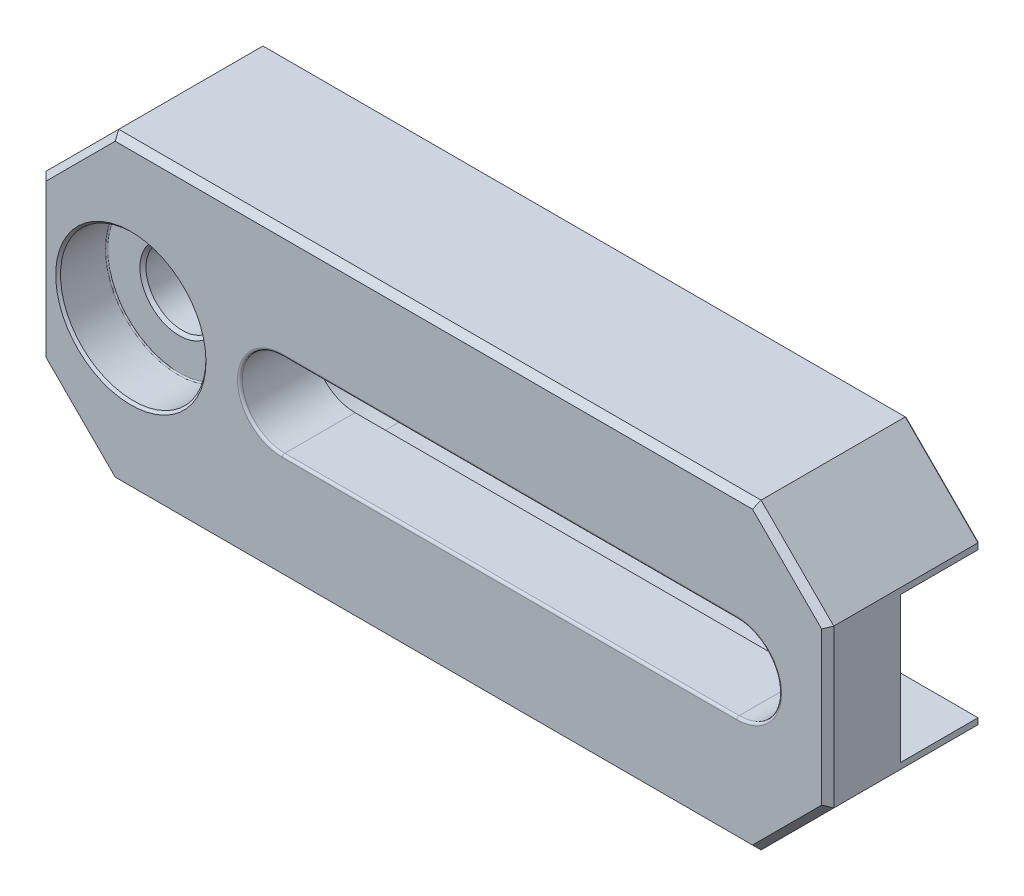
from build123d import *

# Parameters (mm, degrees)
ESQUISSE1_W             = 65
ESQUISSE1_H             = 25
BASE_EXTRUSION_DEPTH    = 12.5
PER_AGE1_D              = 6
PER_AGE1_CBORE_D        = 12
PER_AGE1_CBORE_DEPTH    = 4
ENL_V_MAT_EXTRU_1_DEPTH = 6.5
ENL_V_MAT_EXTRU_2_REACH = 69.361
CHANFREIN5_SIZE         = 6
CHANFREIN6_SIZE         = 0.5
CONG_1_R                = 0.2
CHANFREIN7_SIZE         = 0.2
CONG_2_R                = 0.1
CHANFREIN8_SIZE         = 0.25
CHANFREIN9_SIZE         = 0.1


with BuildPart() as part:
    # Esquisse1 → Base-Extrusion (new body)
    with BuildSketch(Plane(origin=(0, 0, 0), x_dir=(-1, 0, 0), z_dir=(0, 0, -1))):
        with Locations((-32.5, 0)):
            Rectangle(ESQUISSE1_W, ESQUISSE1_H)
    extrude(amount=-BASE_EXTRUSION_DEPTH)

    # Per_age1 (through all)
    with Locations(Plane.XY.offset(12.5)):
        with Locations((7.5, 0)):
            CounterBoreHole(PER_AGE1_D / 2, PER_AGE1_CBORE_D / 2, PER_AGE1_CBORE_DEPTH)

    # Esquisse4 → Enl_v. mat.-Extru.1 (cut)
    with BuildSketch(Plane(origin=(0, 0, 0), x_dir=(-1, 0, 0), z_dir=(0, 0, -1))):
        with BuildLine():
            Line((-70, -6), (-20, -6))
            ThreePointArc((-20, -6), (-14, 0), (-20, 6))
            Line((-20, 6), (-70, 6))
            Line((-70, 6), (-70, -6))
        make_face()
    extrude(amount=-ENL_V_MAT_EXTRU_1_DEPTH, mode=Mode.SUBTRACT)

    # Esquisse5 → Enl_v. mat.-Extru.2 (cut, up to next)
    with BuildSketch(Plane.XY.offset(12.5), mode=Mode.PRIVATE) as enl_v_mat_extru_2_sk1:
        with BuildLine():
            Line((57.5, 3.5), (20, 3.5))
            ThreePointArc((20, 3.5), (16.5, 0), (20, -3.5))
            Line((20, -3.5), (57.5, -3.5))
            ThreePointArc((57.5, -3.5), (61, 0), (57.5, 3.5))
        make_face()
    enl_v_mat_extru_2_tool1 = extrude(enl_v_mat_extru_2_sk1.sketch, amount=-ENL_V_MAT_EXTRU_2_REACH, mode=Mode.PRIVATE) & part.part
    add(enl_v_mat_extru_2_tool1.solids().sort_by_distance((38.75, 0, 12.5))[0], mode=Mode.SUBTRACT)

    # Chanfrein5
    chanfrein5_edges = [part.edges().sort_by_distance(p)[0] for p in [
        (0, -12.5, 6.25),
        (65, -12.5, 6.25),
        (65, 12.5, 6.25),
        (0, 12.5, 6.25),
    ]]
    chamfer(chanfrein5_edges, length=CHANFREIN5_SIZE)

    # Chanfrein6
    chanfrein6_edges = [part.edges().sort_by_distance(p)[0] for p in [
        (0, 0, 12.5),
        (32.5, 12.5, 12.5),
        (32.5, -12.5, 12.5),
        (65, 0, 12.5),
        (62, 9.5, 12.5),
        (62, -9.5, 12.5),
        (3, -9.5, 12.5),
        (3, 9.5, 12.5),
    ]]
    chamfer(chanfrein6_edges, length=CHANFREIN6_SIZE)

    # Cong_1
    cong_1_edges = [part.edges().sort_by_distance(p)[0] for p in [
        (61, 0, 12.5),
        (38.75, 3.5, 12.5),
        (16.5, 0, 12.5),
        (38.75, -3.5, 12.5),
    ]]
    fillet(cong_1_edges, radius=CONG_1_R)

    # Chanfrein7
    chanfrein7_edges = [part.edges().sort_by_distance(p)[0] for p in [
        (1.5, 0, 12.5),
    ]]
    chamfer(chanfrein7_edges, length=CHANFREIN7_SIZE)

    # Cong_2
    cong_2_edges = [part.edges().sort_by_distance(p)[0] for p in [
        (1.5, 0, 8.5),
    ]]
    fillet(cong_2_edges, radius=CONG_2_R)

    # Chanfrein8
    chanfrein8_edges = [part.edges().sort_by_distance(p)[0] for p in [
        (10.5, 0, 8.5),
    ]]
    chamfer(chanfrein8_edges, length=CHANFREIN8_SIZE)

    # Chanfrein9
    chanfrein9_edges = [part.edges().sort_by_distance(p)[0] for p in [
        (65, -6.25, 0),
        (42.5, -6, 0),
        (14, 0, 0),
        (42.5, 6, 0),
        (0, 0, 0),
        (65, 6.25, 0),
        (32.5, -12.5, 0),
        (32.5, 12.5, 0),
        (62, 9.5, 0),
        (62, -9.5, 0),
        (3, -9.5, 0),
        (3, 9.5, 0),
    ]]
    chamfer(chanfrein9_edges, length=CHANFREIN9_SIZE)


solid = part.part
